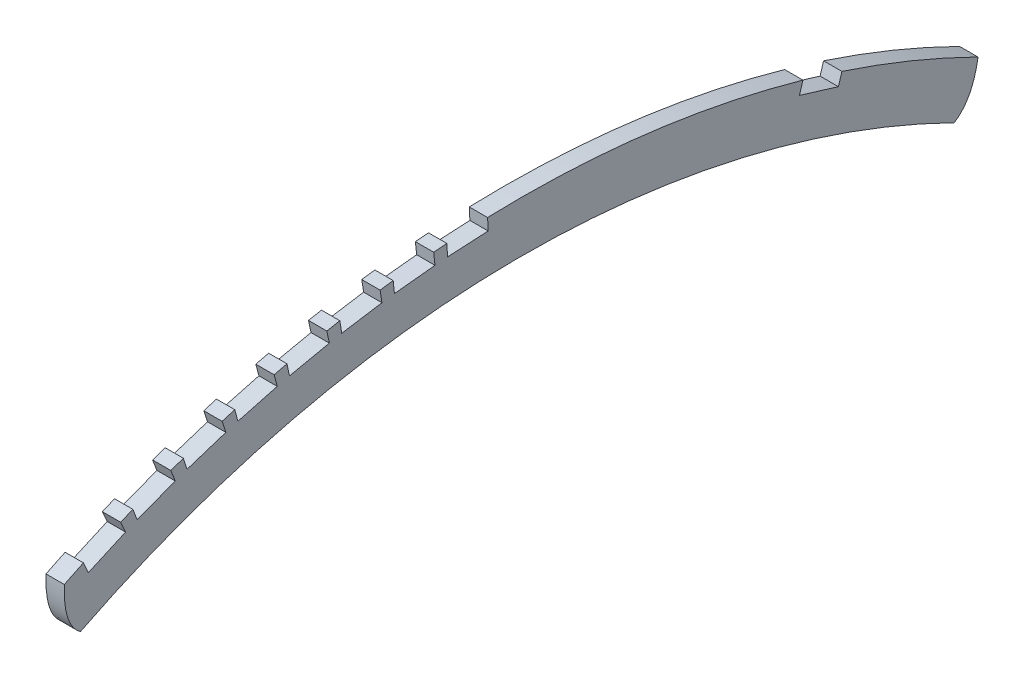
from build123d import *

# Parameters (mm, degrees)
BOSS_EXTRUDE1_DEPTH = 18


with BuildPart() as part:
    # Sketch1 → Boss-Extrude1 (new body)
    with BuildSketch(Plane(origin=(0, 0, 0), x_dir=(0, 0, -1), z_dir=(1, 0, 0))):
        with BuildLine():
            Line((314.948470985, 961.743958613), (311.497799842, 950.457321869))
            Line((311.497799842, 950.457321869), (292.371704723, 956.304755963))
            Line((292.371704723, 956.304755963), (273.245609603, 962.152190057))
            Line((273.245609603, 962.152190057), (276.696280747, 973.438826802))
            ThreePointArc((276.696280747, 973.438826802), (123.3317744, 1004.456696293), (-32.981052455, 1011.462422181))
            Line((-32.981052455, 1011.462422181), (-32.363365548, 999.676253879))
            Line((-32.363365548, 999.676253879), (-52.335956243, 998.629534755))
            Line((-52.335956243, 998.629534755), (-72.308546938, 997.58281563))
            Line((-72.308546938, 997.58281563), (-72.926233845, 1009.368983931))
            ThreePointArc((-72.926233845, 1009.368983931), (-79.400604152, 1008.88033253), (-85.871706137, 1008.350153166))
            Line((-85.871706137, 1008.350153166), (-84.63802536, 996.612464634))
            Line((-84.63802536, 996.612464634), (-104.528463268, 994.521895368))
            Line((-104.528463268, 994.521895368), (-124.418901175, 992.431326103))
            Line((-124.418901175, 992.431326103), (-125.652581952, 1004.169014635))
            ThreePointArc((-125.652581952, 1004.169014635), (-132.092505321, 1003.342190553), (-138.526991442, 1002.474066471))
            Line((-138.526991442, 1002.474066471), (-136.680698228, 990.817029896))
            Line((-136.680698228, 990.817029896), (-156.43446504, 987.688340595))
            Line((-156.43446504, 987.688340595), (-176.188231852, 984.559651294))
            Line((-176.188231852, 984.559651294), (-178.034525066, 996.216687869))
            ThreePointArc((-178.034525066, 996.216687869), (-184.422350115, 995.053957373), (-190.802583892, 993.850268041))
            Line((-190.802583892, 993.850268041), (-188.348738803, 982.30583455))
            Line((-188.348738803, 982.30583455), (-207.911690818, 978.147600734))
            Line((-207.911690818, 978.147600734), (-227.474642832, 973.989366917))
            Line((-227.474642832, 973.989366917), (-229.928487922, 985.533800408))
            ThreePointArc((-229.928487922, 985.533800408), (-236.246706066, 984.038350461), (-242.555199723, 982.502395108))
            Line((-242.555199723, 982.502395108), (-239.500528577, 971.102207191))
            Line((-239.500528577, 971.102207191), (-258.819045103, 965.925826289))
            Line((-258.819045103, 965.925826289), (-278.137561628, 960.749445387))
            Line((-278.137561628, 960.749445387), (-281.192232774, 972.149633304))
            ThreePointArc((-281.192232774, 972.149633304), (-287.423526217, 970.32556283), (-293.64298861, 968.461551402))
            Line((-293.64298861, 968.461551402), (-289.995864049, 957.236856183))
            Line((-289.995864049, 957.236856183), (-309.016994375, 951.056516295))
            Line((-309.016994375, 951.056516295), (-328.038124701, 944.876176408))
            Line((-328.038124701, 944.876176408), (-331.685249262, 956.100871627))
            ThreePointArc((-331.685249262, 956.100871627), (-337.812538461, 953.953180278), (-343.925922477, 951.766221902))
            Line((-343.925922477, 951.766221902), (-339.696341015, 940.747785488))
            Line((-339.696341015, 940.747785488), (-358.367949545, 933.580426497))
            Line((-358.367949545, 933.580426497), (-377.039558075, 926.413067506))
            Line((-377.039558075, 926.413067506), (-381.269139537, 937.43150392))
            ThreePointArc((-381.269139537, 937.43150392), (-387.275630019, 934.966078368), (-393.266179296, 932.462167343))
            Line((-393.266179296, 932.462167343), (-388.465733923, 921.680190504))
            Line((-388.465733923, 921.680190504), (-406.736643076, 913.545457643))
            Line((-406.736643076, 913.545457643), (-425.007552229, 905.410724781))
            Line((-425.007552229, 905.410724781), (-429.807997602, 916.19270162))
            ThreePointArc((-429.807997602, 916.19270162), (-439.214016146, 911.720916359), (-448.573516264, 907.1525681))
            add(Edge.make_bspline(
                [(-448.573516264, 907.1525681), (-449.4459519, 883.276847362), (-444.157653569, 867.289284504), (-432.70862127, 859.189879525)],
                knots=[0, 0, 0, 0, 0.457409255, 0.457409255, 0.457409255, 0.457409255], degree=3))
            ThreePointArc((-432.70862127, 859.189879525), (-4.173095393, 961.990948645), (425.238183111, 862.911633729))
            add(Edge.make_bspline(
                [(425.238183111, 862.911633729), (437.404278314, 870.699351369), (445.18272273, 885.446329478), (448.573516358, 907.152568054)],
                knots=[0.531870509, 0.531870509, 0.531870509, 0.531870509, 1, 1, 1, 1], degree=3))
            ThreePointArc((448.573516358, 907.152568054), (382.735563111, 936.833747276), (314.948470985, 961.743958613))
        make_face()
    extrude(amount=BOSS_EXTRUDE1_DEPTH)


solid = part.part
